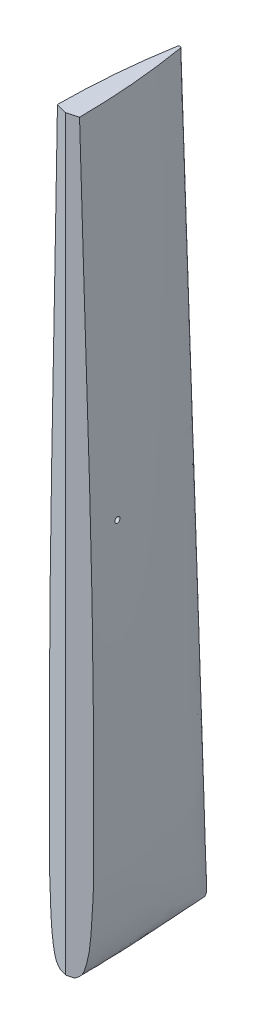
ISO-10303-21;
HEADER;
FILE_DESCRIPTION(('STEP AP214'),'2;1');
FILE_NAME('part.step','',(''),(''),'','','');
FILE_SCHEMA(('AUTOMOTIVE_DESIGN { 1 0 10303 214 1 1 1 1 }'));
ENDSEC;
DATA;
#1=APPLICATION_CONTEXT('core data for automotive mechanical design processes');
#2=APPLICATION_PROTOCOL_DEFINITION('international standard','automotive_design',2000,#1);
#3=PRODUCT_CONTEXT('',#1,'mechanical');
#4=PRODUCT('Part','Part','',(#3));
#5=PRODUCT_RELATED_PRODUCT_CATEGORY('part','',(#4));
#6=PRODUCT_DEFINITION_FORMATION('','',#4);
#7=PRODUCT_DEFINITION_CONTEXT('part definition',#1,'design');
#8=PRODUCT_DEFINITION('design','',#6,#7);
#9=PRODUCT_DEFINITION_SHAPE('','',#8);
#10=(LENGTH_UNIT() NAMED_UNIT(*) SI_UNIT(.MILLI.,.METRE.));
#11=(NAMED_UNIT(*) PLANE_ANGLE_UNIT() SI_UNIT($,.RADIAN.));
#12=(NAMED_UNIT(*) SI_UNIT($,.STERADIAN.) SOLID_ANGLE_UNIT());
#13=UNCERTAINTY_MEASURE_WITH_UNIT(LENGTH_MEASURE(1.E-05),#10,'distance_accuracy_value','');
#14=(GEOMETRIC_REPRESENTATION_CONTEXT(3) GLOBAL_UNCERTAINTY_ASSIGNED_CONTEXT((#13)) GLOBAL_UNIT_ASSIGNED_CONTEXT((#10,
#11,#12)) REPRESENTATION_CONTEXT('',''));
#15=CARTESIAN_POINT('',(0.,0.,0.));
#16=DIRECTION('',(0.,0.,1.));
#17=DIRECTION('',(1.,0.,0.));
#18=AXIS2_PLACEMENT_3D('',#15,#16,#17);
#19=CARTESIAN_POINT('',(-19.9884252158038,1862.44260537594,-6592.01307514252));
#20=CARTESIAN_POINT('',(-26.8934107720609,1534.70306334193,-6593.86326045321));
#21=CARTESIAN_POINT('',(-40.0090450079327,1193.89190828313,-6597.37757862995));
#22=CARTESIAN_POINT('',(-39.9456415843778,806.598983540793,-6597.3605964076));
#23=CARTESIAN_POINT('',(-39.6360081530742,736.310169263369,-6597.27761550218));
#24=CARTESIAN_POINT('',(-40.237000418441,657.372017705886,-6597.43867853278));
#25=CARTESIAN_POINT('',(-37.1722435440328,600.953489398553,-6596.61733831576));
#26=CARTESIAN_POINT('',(-34.4358947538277,551.281638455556,-6595.88426878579));
#27=CARTESIAN_POINT('',(-25.1261638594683,521.188880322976,-6593.38972770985));
#28=CARTESIAN_POINT('',(-18.4924407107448,514.41161983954,-6591.61222751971));
#29=CARTESIAN_POINT('',(-14.515562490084,511.746648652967,-6590.54662609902));
#30=CARTESIAN_POINT('',(-12.7654577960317,510.947751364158,-6590.07768688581));
#31=CARTESIAN_POINT('',(-19.9162503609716,1862.44260537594,-6608.71237045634));
#32=CARTESIAN_POINT('',(-26.6824629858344,1534.70302438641,-6611.44424600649));
#33=CARTESIAN_POINT('',(-39.7387025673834,1193.89190559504,-6615.83895151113));
#34=CARTESIAN_POINT('',(-39.6886844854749,806.598984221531,-6616.91658362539));
#35=CARTESIAN_POINT('',(-39.3845017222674,736.310161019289,-6617.02920022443));
#36=CARTESIAN_POINT('',(-39.9824966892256,657.372026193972,-6617.41780383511));
#37=CARTESIAN_POINT('',(-36.9483672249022,600.953412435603,-6616.73160858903));
#38=CARTESIAN_POINT('',(-34.2764068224,551.281840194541,-6616.18408088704));
#39=CARTESIAN_POINT('',(-25.0234337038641,521.188786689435,-6613.92521516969));
#40=CARTESIAN_POINT('',(-18.4583589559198,514.411767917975,-6612.17071322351));
#41=CARTESIAN_POINT('',(-14.4660919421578,511.746435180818,-6611.04009092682));
#42=CARTESIAN_POINT('',(-12.7433551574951,510.94775136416,-6610.52794310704));
#43=CARTESIAN_POINT('',(-19.0972393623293,1862.44260537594,-6642.06855271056));
#44=CARTESIAN_POINT('',(-25.5859061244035,1534.70294647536,-6646.56380873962));
#45=CARTESIAN_POINT('',(-37.7898809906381,1193.89190019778,-6652.71868118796));
#46=CARTESIAN_POINT('',(-37.7663977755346,806.598985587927,-6656.00318671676));
#47=CARTESIAN_POINT('',(-37.4864367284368,736.310144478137,-6656.5087060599));
#48=CARTESIAN_POINT('',(-38.0492083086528,657.372043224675,-6657.35830076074));
#49=CARTESIAN_POINT('',(-35.2196602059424,600.953258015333,-6656.93233834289));
#50=CARTESIAN_POINT('',(-32.6738335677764,551.282243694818,-6656.78619940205));
#51=CARTESIAN_POINT('',(-23.9683476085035,521.188599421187,-6655.02363964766));
#52=CARTESIAN_POINT('',(-17.7186768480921,514.412064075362,-6653.30803096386));
#53=CARTESIAN_POINT('',(-13.9706664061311,511.746008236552,-6652.03296403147));
#54=CARTESIAN_POINT('',(-12.3026654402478,510.947751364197,-6651.43439899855));
#55=CARTESIAN_POINT('',(-15.8536834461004,1862.44260537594,-6691.98307498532));
#56=CARTESIAN_POINT('',(-20.9725671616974,1534.70151698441,-6699.07198246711));
#57=CARTESIAN_POINT('',(-30.6765162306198,1193.89219290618,-6707.64087913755));
#58=CARTESIAN_POINT('',(-30.6737922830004,806.598921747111,-6714.26869760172));
#59=CARTESIAN_POINT('',(-30.4606008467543,736.31082502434,-6715.37486588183));
#60=CARTESIAN_POINT('',(-30.9002872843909,657.371342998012,-6716.91121172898));
#61=CARTESIAN_POINT('',(-28.7105620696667,600.959605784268,-6716.93618776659));
#62=CARTESIAN_POINT('',(-26.6535621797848,551.265581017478,-6717.4288279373));
#63=CARTESIAN_POINT('',(-19.7263008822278,521.196333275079,-6716.58548223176));
#64=CARTESIAN_POINT('',(-14.7624577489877,514.399833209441,-6714.95211653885));
#65=CARTESIAN_POINT('',(-11.7932212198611,511.763640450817,-6713.52257822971));
#66=CARTESIAN_POINT('',(-10.4518622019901,510.947751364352,-6712.77450785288));
#67=CARTESIAN_POINT('',(-10.5927394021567,1862.44260537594,-6741.78456812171));
#68=CARTESIAN_POINT('',(-13.6238322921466,1534.69958378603,-6751.14749141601));
#69=CARTESIAN_POINT('',(-19.4031656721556,1193.89308319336,-6761.90032273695));
#70=CARTESIAN_POINT('',(-19.4067289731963,806.598723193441,-6771.88321733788));
#71=CARTESIAN_POINT('',(-19.2916218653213,736.312987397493,-6773.60315615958));
#72=CARTESIAN_POINT('',(-19.5365227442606,657.369117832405,-6775.80793381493));
#73=CARTESIAN_POINT('',(-18.3291502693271,600.97977832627,-6776.38989807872));
#74=CARTESIAN_POINT('',(-16.9875731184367,551.21263875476,-6777.64892158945));
#75=CARTESIAN_POINT('',(-12.8636519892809,521.220905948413,-6777.8448849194));
#76=CARTESIAN_POINT('',(-9.92504748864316,514.360972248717,-6776.48834876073));
#77=CARTESIAN_POINT('',(-8.24044361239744,511.819663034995,-6774.88404182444));
#78=CARTESIAN_POINT('',(-7.41257612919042,510.947751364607,-6774.05764416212));
#79=CARTESIAN_POINT('',(-5.73178554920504,1862.44260537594,-6774.91438434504));
#80=CARTESIAN_POINT('',(-6.95005337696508,1534.69844182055,-6785.93160088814));
#81=CARTESIAN_POINT('',(-9.14031393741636,1193.89333758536,-6797.45035419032));
#82=CARTESIAN_POINT('',(-9.14698438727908,806.598667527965,-6809.66951714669));
#83=CARTESIAN_POINT('',(-9.11443164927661,736.313582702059,-6811.81722411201));
#84=CARTESIAN_POINT('',(-9.19165029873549,657.368505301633,-6814.42920370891));
#85=CARTESIAN_POINT('',(-8.82374017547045,600.985331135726,-6815.57274283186));
#86=CARTESIAN_POINT('',(-8.20497107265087,551.198059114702,-6817.19289755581));
#87=CARTESIAN_POINT('',(-6.53260109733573,521.227673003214,-6818.43992058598));
#88=CARTESIAN_POINT('',(-5.49926350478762,514.350270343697,-6817.25245268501));
#89=CARTESIAN_POINT('',(-4.89204023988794,511.835091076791,-6815.84841990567));
#90=CARTESIAN_POINT('',(-4.59593421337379,510.947751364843,-6814.85022402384));
#91=CARTESIAN_POINT('',(-2.90726529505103,1862.44260537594,-6791.769707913));
#92=CARTESIAN_POINT('',(-3.01822730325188,1534.69799037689,-6803.25171530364));
#93=CARTESIAN_POINT('',(-3.22420466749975,1193.89361058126,-6815.35476177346));
#94=CARTESIAN_POINT('',(-3.23358048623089,806.598606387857,-6828.70698397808));
#95=CARTESIAN_POINT('',(-3.24789930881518,736.314251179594,-6831.07101484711));
#96=CARTESIAN_POINT('',(-3.23097702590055,657.36781739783,-6833.89211280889));
#97=CARTESIAN_POINT('',(-3.33625141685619,600.991567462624,-6835.30790331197));
#98=CARTESIAN_POINT('',(-3.13502808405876,551.18168983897,-6837.3147342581));
#99=CARTESIAN_POINT('',(-2.87490401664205,521.23527067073,-6838.94108612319));
#100=CARTESIAN_POINT('',(-2.9333002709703,514.338254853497,-6838.05836064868));
#101=CARTESIAN_POINT('',(-2.95172261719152,511.852412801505,-6836.53179707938));
#102=CARTESIAN_POINT('',(-2.96093290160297,510.94775136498,-6835.60286038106));
#103=CARTESIAN_POINT('',(-2.703821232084,1862.44260537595,-6792.39226174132));
#104=CARTESIAN_POINT('',(-2.7742950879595,1534.6979740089,-6803.89095612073));
#105=CARTESIAN_POINT('',(-2.907831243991,1193.89362062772,-6815.99160510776));
#106=CARTESIAN_POINT('',(-2.9073287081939,806.598604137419,-6829.37180240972));
#107=CARTESIAN_POINT('',(-2.92371771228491,736.314275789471,-6831.74552665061));
#108=CARTESIAN_POINT('',(-2.89782128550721,657.367792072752,-6834.56407168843));
#109=CARTESIAN_POINT('',(-3.01962940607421,600.991797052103,-6836.0060169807));
#110=CARTESIAN_POINT('',(-2.82905251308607,551.181087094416,-6838.00840111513));
#111=CARTESIAN_POINT('',(-2.60372173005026,521.235550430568,-6839.63038574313));
#112=CARTESIAN_POINT('',(-2.69697069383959,514.337812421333,-6838.77944870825));
#113=CARTESIAN_POINT('',(-2.73651776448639,511.853050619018,-6837.26894546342));
#114=CARTESIAN_POINT('',(-2.75688080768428,510.947751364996,-6836.34263948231));
#115=CARTESIAN_POINT('',(-2.06532865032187,1862.44260537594,-6793.23024546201));
#116=CARTESIAN_POINT('',(-2.08668633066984,1534.69794386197,-6804.71457469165));
#117=CARTESIAN_POINT('',(-2.1364273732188,1193.8936797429,-6816.78424857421));
#118=CARTESIAN_POINT('',(-2.12446989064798,806.598590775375,-6830.17736325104));
#119=CARTESIAN_POINT('',(-2.13222259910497,736.314423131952,-6832.55257814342));
#120=CARTESIAN_POINT('',(-2.11437427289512,657.367640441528,-6835.37450189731));
#121=CARTESIAN_POINT('',(-2.21967160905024,600.993171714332,-6836.86253061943));
#122=CARTESIAN_POINT('',(-2.06697412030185,551.177479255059,-6838.8259519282));
#123=CARTESIAN_POINT('',(-1.89886843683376,521.237224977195,-6840.4298400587));
#124=CARTESIAN_POINT('',(-1.99791275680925,514.335164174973,-6839.63709782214));
#125=CARTESIAN_POINT('',(-2.04673541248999,511.856868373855,-6838.16225068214));
#126=CARTESIAN_POINT('',(-2.07232559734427,510.947751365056,-6837.25409808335));
#127=CARTESIAN_POINT('',(-1.12493338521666,1862.44260537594,-6793.82303299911));
#128=CARTESIAN_POINT('',(-1.12473486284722,1534.69791711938,-6805.28426211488));
#129=CARTESIAN_POINT('',(-1.13457216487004,1193.89372959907,-6817.31562936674));
#130=CARTESIAN_POINT('',(-1.12089486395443,806.598579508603,-6830.6998133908));
#131=CARTESIAN_POINT('',(-1.12856913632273,736.314547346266,-6833.08733839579));
#132=CARTESIAN_POINT('',(-1.10958429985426,657.367512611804,-6835.88419772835));
#133=CARTESIAN_POINT('',(-1.17782823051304,600.994330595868,-6837.42807743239));
#134=CARTESIAN_POINT('',(-1.08908087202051,551.174437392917,-6839.35155551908));
#135=CARTESIAN_POINT('',(-0.997618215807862,521.238636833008,-6840.91757005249));
#136=CARTESIAN_POINT('',(-1.06011190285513,514.332931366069,-6840.18539431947));
#137=CARTESIAN_POINT('',(-1.09254822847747,511.86008722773,-6838.7441047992));
#138=CARTESIAN_POINT('',(-1.1097593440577,510.947751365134,-6837.85078941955));
#139=CARTESIAN_POINT('',(-1.03955804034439E-07,1862.44260537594,-6794.03879446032));
#140=CARTESIAN_POINT('',(-9.88560035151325E-08,1534.69790612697,-6805.48836037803));
#141=CARTESIAN_POINT('',(9.66866766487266E-06,1193.89375068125,-6817.4979327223));
#142=CARTESIAN_POINT('',(-2.30349892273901E-06,806.598574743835,-6830.88198500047));
#143=CARTESIAN_POINT('',(2.44293330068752E-05,736.314599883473,-6833.26147901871));
#144=CARTESIAN_POINT('',(-2.53190806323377E-05,657.3674585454,-6836.07142055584));
#145=CARTESIAN_POINT('',(0.000228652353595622,600.994820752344,-6837.62150865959));
#146=CARTESIAN_POINT('',(-1.016185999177E-05,551.173150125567,-6839.53005486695));
#147=CARTESIAN_POINT('',(3.5309967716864E-07,521.239234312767,-6841.08915153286));
#148=CARTESIAN_POINT('',(-1.41525642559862E-07,514.331986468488,-6840.3732158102));
#149=CARTESIAN_POINT('',(-1.02709098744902E-07,511.861449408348,-6838.9449439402));
#150=CARTESIAN_POINT('',(-1.12059392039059E-07,510.947751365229,-6838.05820848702));
#151=CARTESIAN_POINT('',(1.12493321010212,1862.44260537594,-6793.82303307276));
#152=CARTESIAN_POINT('',(1.12473469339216,1534.69791711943,-6805.28426217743));
#153=CARTESIAN_POINT('',(1.13459150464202,1193.89372956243,-6817.31562936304));
#154=CARTESIAN_POINT('',(1.12089028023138,806.598579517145,-6830.69981344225));
#155=CARTESIAN_POINT('',(1.12861796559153,736.314547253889,-6833.08733831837));
#156=CARTESIAN_POINT('',(1.10953372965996,657.36751270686,-6835.8841978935));
#157=CARTESIAN_POINT('',(1.17828513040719,600.994329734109,-6837.42807634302));
#158=CARTESIAN_POINT('',(1.0890605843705,551.174437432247,-6839.35155561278));
#159=CARTESIAN_POINT('',(0.997618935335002,521.238636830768,-6840.9175700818));
#160=CARTESIAN_POINT('',(1.06011163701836,514.332931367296,-6840.18539436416));
#161=CARTESIAN_POINT('',(1.09254804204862,511.860087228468,-6838.74410484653));
#162=CARTESIAN_POINT('',(1.1097591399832,510.947751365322,-6837.85078946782));
#163=CARTESIAN_POINT('',(2.06532855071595,1862.44260537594,-6793.23024556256));
#164=CARTESIAN_POINT('',(2.08668622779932,1534.69794386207,-6804.7145747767));
#165=CARTESIAN_POINT('',(2.13644672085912,1193.89367967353,-6816.78424855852));
#166=CARTESIAN_POINT('',(2.12446536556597,806.598590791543,-6830.17736332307));
#167=CARTESIAN_POINT('',(2.13227136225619,736.314422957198,-6832.55257801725));
#168=CARTESIAN_POINT('',(2.11432386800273,657.367640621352,-6835.37450214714));
#169=CARTESIAN_POINT('',(2.2201274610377,600.993170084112,-6836.86252895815));
#170=CARTESIAN_POINT('',(2.06695392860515,551.177479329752,-6838.82595206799));
#171=CARTESIAN_POINT('',(1.89886918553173,521.23722497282,-6840.42984010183));
#172=CARTESIAN_POINT('',(1.99791253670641,514.335164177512,-6839.63709788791));
#173=CARTESIAN_POINT('',(2.04673527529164,511.856868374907,-6838.16225074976));
#174=CARTESIAN_POINT('',(2.07232544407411,510.947751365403,-6837.25409815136));
#175=CARTESIAN_POINT('',(2.70382120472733,1862.44260537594,-6792.3922618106));
#176=CARTESIAN_POINT('',(2.77429505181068,1534.69797400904,-6803.89095617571));
#177=CARTESIAN_POINT('',(2.90785059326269,1193.89362053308,-6815.99160507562));
#178=CARTESIAN_POINT('',(2.90732425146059,806.598604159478,-6829.37180245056));
#179=CARTESIAN_POINT('',(2.9237663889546,736.314275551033,-6831.74552653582));
#180=CARTESIAN_POINT('',(2.89777108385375,657.367792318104,-6834.56407187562));
#181=CARTESIAN_POINT('',(3.0200839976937,600.99179482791,-6836.00601561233));
#182=CARTESIAN_POINT('',(2.82903243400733,551.18108719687,-6838.00840122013));
#183=CARTESIAN_POINT('',(2.60372252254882,521.235550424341,-6839.63038576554));
#184=CARTESIAN_POINT('',(2.69697052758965,514.337812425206,-6838.77944875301));
#185=CARTESIAN_POINT('',(2.73651768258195,511.853050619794,-6837.26894550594));
#186=CARTESIAN_POINT('',(2.75688071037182,510.94775136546,-6836.34263952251));
#187=CARTESIAN_POINT('',(2.90726529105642,1862.44260537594,-6791.76970793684));
#188=CARTESIAN_POINT('',(3.01822729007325,1534.69799037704,-6803.2517153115));
#189=CARTESIAN_POINT('',(3.22422401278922,1193.89361047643,-6815.35476172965));
#190=CARTESIAN_POINT('',(3.23357605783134,806.598606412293,-6828.70698396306));
#191=CARTESIAN_POINT('',(3.24794794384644,736.314250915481,-6831.07101477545));
#192=CARTESIAN_POINT('',(3.23092691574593,657.367817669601,-6833.89211285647));
#193=CARTESIAN_POINT('',(3.33670541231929,600.991564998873,-6835.30790274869));
#194=CARTESIAN_POINT('',(3.13500805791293,551.181689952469,-6837.31473427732));
#195=CARTESIAN_POINT('',(2.87490482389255,521.235270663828,-6838.9410861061));
#196=CARTESIAN_POINT('',(2.93330012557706,514.338254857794,-6838.05836064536));
#197=CARTESIAN_POINT('',(2.95172255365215,511.852412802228,-6836.53179707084));
#198=CARTESIAN_POINT('',(2.96093282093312,510.947751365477,-6835.60286036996));
#199=CARTESIAN_POINT('',(5.73178554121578,1862.44260537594,-6774.91438439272));
#200=CARTESIAN_POINT('',(6.95005326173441,1534.69844182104,-6785.9316009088));
#201=CARTESIAN_POINT('',(9.14033266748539,1193.89333730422,-6797.450355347));
#202=CARTESIAN_POINT('',(9.14697975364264,806.598667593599,-6809.66951678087));
#203=CARTESIAN_POINT('',(9.11447915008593,736.313581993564,-6811.81722715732));
#204=CARTESIAN_POINT('',(9.19160085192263,657.368506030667,-6814.42920044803));
#205=CARTESIAN_POINT('',(8.82418561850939,600.985324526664,-6815.57277175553));
#206=CARTESIAN_POINT('',(8.20495119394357,551.198059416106,-6817.19289617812));
#207=CARTESIAN_POINT('',(6.53260156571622,521.227672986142,-6818.43992061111));
#208=CARTESIAN_POINT('',(5.49926312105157,514.350270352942,-6817.25245261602));
#209=CARTESIAN_POINT('',(4.89203991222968,511.835091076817,-6815.84841987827));
#210=CARTESIAN_POINT('',(4.59593384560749,510.947751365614,-6814.85022399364));
#211=CARTESIAN_POINT('',(10.5927394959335,1862.44260537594,-6741.78456754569));
#212=CARTESIAN_POINT('',(13.6238321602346,1534.69958378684,-6751.14749071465));
#213=CARTESIAN_POINT('',(19.4031834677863,1193.89308260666,-6761.90032631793));
#214=CARTESIAN_POINT('',(19.4067242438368,806.598723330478,-6771.88321540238));
#215=CARTESIAN_POINT('',(19.2916673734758,736.312985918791,-6773.60316644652));
#216=CARTESIAN_POINT('',(19.5364749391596,657.369119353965,-6775.80792141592));
#217=CARTESIAN_POINT('',(18.329578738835,600.97976453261,-6776.39000142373));
#218=CARTESIAN_POINT('',(16.9875537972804,551.212639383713,-6777.64891596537));
#219=CARTESIAN_POINT('',(12.8636520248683,521.220905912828,-6777.84488426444));
#220=CARTESIAN_POINT('',(9.92504680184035,514.360972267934,-6776.48834776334));
#221=CARTESIAN_POINT('',(8.24044290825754,511.819663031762,-6774.8840408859));
#222=CARTESIAN_POINT('',(7.41257534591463,510.947751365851,-6774.05764327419));
#223=CARTESIAN_POINT('',(15.8536836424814,1862.44260537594,-6691.98307288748));
#224=CARTESIAN_POINT('',(20.9725670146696,1534.70151698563,-6699.07198014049));
#225=CARTESIAN_POINT('',(30.6765333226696,1193.89219198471,-6707.64088646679));
#226=CARTESIAN_POINT('',(30.6737874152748,806.598921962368,-6714.26869251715));
#227=CARTESIAN_POINT('',(30.4606449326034,736.310822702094,-6715.37488814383));
#228=CARTESIAN_POINT('',(30.9002405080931,657.371345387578,-6716.91118313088));
#229=CARTESIAN_POINT('',(28.7109790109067,600.959584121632,-6716.93641861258));
#230=CARTESIAN_POINT('',(26.6535431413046,551.265582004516,-6717.42881447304));
#231=CARTESIAN_POINT('',(19.7263005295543,521.196333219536,-6716.58547991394));
#232=CARTESIAN_POINT('',(14.7624567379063,514.399833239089,-6714.95211338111));
#233=CARTESIAN_POINT('',(11.7932201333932,511.763640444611,-6713.5225752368));
#234=CARTESIAN_POINT('',(10.4518610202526,510.947751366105,-6712.77450495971));
#235=CARTESIAN_POINT('',(19.0972394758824,1862.44260537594,-6642.06855005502));
#236=CARTESIAN_POINT('',(25.5859057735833,1534.7029464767,-6646.56380578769));
#237=CARTESIAN_POINT('',(37.7898980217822,1193.89189906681,-6652.71869246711));
#238=CARTESIAN_POINT('',(37.7663924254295,806.59898585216,-6656.00317986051));
#239=CARTESIAN_POINT('',(37.4864812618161,736.310141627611,-6656.50873920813));
#240=CARTESIAN_POINT('',(38.0491602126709,657.372046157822,-6657.35825947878));
#241=CARTESIAN_POINT('',(35.2200848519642,600.953231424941,-6656.93267678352));
#242=CARTESIAN_POINT('',(32.6738137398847,551.282244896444,-6656.78618027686));
#243=CARTESIAN_POINT('',(23.9683469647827,521.188599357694,-6655.02363684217));
#244=CARTESIAN_POINT('',(17.7186755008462,514.41206410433,-6653.30802690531));
#245=CARTESIAN_POINT('',(13.9706650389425,511.746008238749,-6652.03296021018));
#246=CARTESIAN_POINT('',(12.3026640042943,510.947751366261,-6651.43439532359));
#247=CARTESIAN_POINT('',(19.91625036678,1862.44260537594,-6608.71236911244));
#248=CARTESIAN_POINT('',(26.6824625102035,1534.70302438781,-6611.44424446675));
#249=CARTESIAN_POINT('',(39.7387200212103,1193.89190440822,-6615.83896562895));
#250=CARTESIAN_POINT('',(39.6886787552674,806.59898449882,-6616.91657798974));
#251=CARTESIAN_POINT('',(39.3845476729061,736.310158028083,-6617.02923841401));
#252=CARTESIAN_POINT('',(39.9824465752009,657.372029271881,-6617.41776053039));
#253=CARTESIAN_POINT('',(36.9488074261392,600.95338453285,-6616.73198117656));
#254=CARTESIAN_POINT('',(34.2763859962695,551.281841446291,-6616.18406187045));
#255=CARTESIAN_POINT('',(25.0234330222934,521.188786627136,-6613.92521406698));
#256=CARTESIAN_POINT('',(18.4583574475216,514.411767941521,-6612.17071072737));
#257=CARTESIAN_POINT('',(14.466090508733,511.746435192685,-6611.04008869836));
#258=CARTESIAN_POINT('',(12.7433536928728,510.947751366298,-6610.52794102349));
#259=CARTESIAN_POINT('',(19.9884252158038,1862.44260537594,-6592.01307514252));
#260=CARTESIAN_POINT('',(26.8934102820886,1534.70306334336,-6593.86326030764));
#261=CARTESIAN_POINT('',(40.0090628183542,1193.89190708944,-6597.37759423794));
#262=CARTESIAN_POINT('',(39.9456357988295,806.598983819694,-6597.36059234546));
#263=CARTESIAN_POINT('',(39.6360549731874,736.310166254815,-6597.2776552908));
#264=CARTESIAN_POINT('',(40.2369493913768,657.372020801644,-6597.43863682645));
#265=CARTESIAN_POINT('',(37.1726919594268,600.953461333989,-6596.61771260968));
#266=CARTESIAN_POINT('',(34.4358735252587,551.281639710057,-6595.88425140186));
#267=CARTESIAN_POINT('',(25.1261632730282,521.18888026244,-6593.38972825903));
#268=CARTESIAN_POINT('',(18.4924391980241,514.411619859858,-6591.61222667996));
#269=CARTESIAN_POINT('',(14.5155610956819,511.746648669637,-6590.5466255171));
#270=CARTESIAN_POINT('',(12.7654563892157,510.9477513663,-6590.0776864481));
#271=B_SPLINE_SURFACE_WITH_KNOTS('',3,3,((#19,#20,#21,#22,#23,#24,#25,#26,#27,#28,#29,#30),(#31,
#32,#33,#34,#35,#36,#37,#38,#39,#40,#41,#42),(#43,#44,#45,#46,#47,#48,#49,#50,#51,#52,#53,#54),
(#55,#56,#57,#58,#59,#60,#61,#62,#63,#64,#65,#66),(#67,#68,#69,#70,#71,#72,#73,#74,#75,#76,#77,
#78),(#79,#80,#81,#82,#83,#84,#85,#86,#87,#88,#89,#90),(#91,#92,#93,#94,#95,#96,#97,#98,#99,
#100,#101,#102),(#103,#104,#105,#106,#107,#108,#109,#110,#111,#112,#113,#114),(#115,#116,#117,
#118,#119,#120,#121,#122,#123,#124,#125,#126),(#127,#128,#129,#130,#131,#132,#133,#134,#135,
#136,#137,#138),(#139,#140,#141,#142,#143,#144,#145,#146,#147,#148,#149,#150),(#151,#152,#153,
#154,#155,#156,#157,#158,#159,#160,#161,#162),(#163,#164,#165,#166,#167,#168,#169,#170,#171,
#172,#173,#174),(#175,#176,#177,#178,#179,#180,#181,#182,#183,#184,#185,#186),(#187,#188,#189,
#190,#191,#192,#193,#194,#195,#196,#197,#198),(#199,#200,#201,#202,#203,#204,#205,#206,#207,
#208,#209,#210),(#211,#212,#213,#214,#215,#216,#217,#218,#219,#220,#221,#222),(#223,#224,#225,
#226,#227,#228,#229,#230,#231,#232,#233,#234),(#235,#236,#237,#238,#239,#240,#241,#242,#243,
#244,#245,#246),(#247,#248,#249,#250,#251,#252,#253,#254,#255,#256,#257,#258),(#259,#260,#261,
#262,#263,#264,#265,#266,#267,#268,#269,#270)),.UNSPECIFIED.,.F.,.F.,.F.,(4,1,1,1,2,1,1,1,1,1,1,
1,2,1,1,1,4),(4,1,1,1,1,1,1,1,1,4),(0.,0.12272175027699,0.24544350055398,0.36816525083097,
0.49088700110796,0.493165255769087,0.495443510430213,0.49772176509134,0.500000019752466,
0.502278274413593,0.504556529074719,0.506834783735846,0.509113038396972,0.631834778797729,
0.754556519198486,0.877278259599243,1.),(0.,0.726006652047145,0.755007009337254,
0.857831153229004,0.881685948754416,0.92986213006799,0.982734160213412,0.992069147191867,
0.996831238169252,1.),.UNSPECIFIED.);
#272=CARTESIAN_POINT('',(1219.21686283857,1862.44260537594,-6586.65719274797));
#273=DIRECTION('',(0.,1.,0.));
#274=DIRECTION('',(0.,0.,-1.));
#275=AXIS2_PLACEMENT_3D('',#272,#273,#274);
#276=CIRCLE('',#275,1239.21686214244);
#277=CARTESIAN_POINT('',(-2.95874510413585,1862.44260537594,-6791.4625021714));
#278=VERTEX_POINT('',#277);
#279=CARTESIAN_POINT('',(-19.988425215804,1862.44260537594,-6592.01307514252));
#280=VERTEX_POINT('',#279);
#281=EDGE_CURVE('E247',#278,#280,#276,.T.);
#282=CARTESIAN_POINT('',(0.,1862.44260537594,-6790.96669231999));
#283=DIRECTION('',(0.,1.,0.));
#284=DIRECTION('',(0.,0.,1.));
#285=AXIS2_PLACEMENT_3D('',#282,#283,#284);
#286=CIRCLE('',#285,2.99999999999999);
#287=CARTESIAN_POINT('',(2.95874510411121,1862.44260537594,-6791.46250217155));
#288=VERTEX_POINT('',#287);
#289=EDGE_CURVE('E413',#288,#278,#286,.T.);
#290=CARTESIAN_POINT('',(-1219.21686283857,1862.44260537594,-6586.65719274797));
#291=DIRECTION('',(0.,1.,0.));
#292=DIRECTION('',(0.,0.,1.));
#293=AXIS2_PLACEMENT_3D('',#290,#291,#292);
#294=CIRCLE('',#293,1239.21686214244);
#295=CARTESIAN_POINT('',(19.9884252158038,1862.44260537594,-6592.01307514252));
#296=VERTEX_POINT('',#295);
#297=EDGE_CURVE('E420',#296,#288,#294,.T.);
#298=CARTESIAN_POINT('',(19.9884252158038,1862.44260537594,-6592.01307514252));
#299=CARTESIAN_POINT('',(26.8934102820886,1534.70306334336,-6593.86326030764));
#300=CARTESIAN_POINT('',(40.0090628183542,1193.89190708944,-6597.37759423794));
#301=CARTESIAN_POINT('',(39.9456357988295,806.598983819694,-6597.36059234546));
#302=CARTESIAN_POINT('',(39.6360549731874,736.310166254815,-6597.2776552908));
#303=CARTESIAN_POINT('',(40.2369493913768,657.372020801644,-6597.43863682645));
#304=CARTESIAN_POINT('',(37.1726919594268,600.953461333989,-6596.61771260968));
#305=CARTESIAN_POINT('',(34.4358735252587,551.281639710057,-6595.88425140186));
#306=CARTESIAN_POINT('',(25.1261632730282,521.18888026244,-6593.38972825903));
#307=CARTESIAN_POINT('',(18.4924391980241,514.411619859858,-6591.61222667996));
#308=CARTESIAN_POINT('',(14.5155610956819,511.746648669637,-6590.5466255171));
#309=CARTESIAN_POINT('',(12.7654563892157,510.9477513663,-6590.0776864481));
#310=B_SPLINE_CURVE_WITH_KNOTS('',3,(#298,#299,#300,#301,#302,#303,#304,#305,#306,#307,#308,
#309),.UNSPECIFIED.,.F.,.F.,(4,1,1,1,1,1,1,1,1,4),(0.,0.726006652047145,0.755007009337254,
0.857831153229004,0.881685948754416,0.92986213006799,0.982734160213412,0.992069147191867,
0.996831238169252,1.),.UNSPECIFIED.);
#311=CARTESIAN_POINT('',(12.7654563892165,510.9477513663,-6590.0776864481));
#312=VERTEX_POINT('',#311);
#313=EDGE_CURVE('E296',#296,#312,#310,.T.);
#314=CARTESIAN_POINT('',(-3152.0100930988,510.947751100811,-6586.65718756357));
#315=DIRECTION('',(-8.38886645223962E-11,1.,0.));
#316=DIRECTION('',(-1.,-8.38886645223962E-11,0.));
#317=AXIS2_PLACEMENT_3D('',#314,#315,#316);
#318=CIRCLE('',#317,3164.77739793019);
#319=CARTESIAN_POINT('',(2.99073241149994,510.94775136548,-6835.2246220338));
#320=VERTEX_POINT('',#319);
#321=EDGE_CURVE('E287',#312,#320,#318,.T.);
#322=CARTESIAN_POINT('',(-4.34023118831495E-08,510.947751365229,-6834.98899651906));
#323=DIRECTION('',(-8.38886645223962E-11,1.,0.));
#324=DIRECTION('',(1.,8.38886645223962E-11,0.));
#325=AXIS2_PLACEMENT_3D('',#322,#323,#324);
#326=CIRCLE('',#325,2.99999999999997);
#327=CARTESIAN_POINT('',(-2.99073249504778,510.947751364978,-6835.22462207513));
#328=VERTEX_POINT('',#327);
#329=EDGE_CURVE('E284',#320,#328,#326,.T.);
#330=CARTESIAN_POINT('',(3152.00940461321,510.947751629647,-6586.65719796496));
#331=DIRECTION('',(-8.38886645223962E-11,1.,0.));
#332=DIRECTION('',(1.,8.38886645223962E-11,0.));
#333=AXIS2_PLACEMENT_3D('',#330,#331,#332);
#334=CIRCLE('',#333,3164.77671084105);
#335=CARTESIAN_POINT('',(-12.765457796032,510.947751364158,-6590.07768688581));
#336=VERTEX_POINT('',#335);
#337=EDGE_CURVE('E280',#328,#336,#334,.T.);
#338=CARTESIAN_POINT('',(-19.9884252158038,1862.44260537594,-6592.01307514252));
#339=CARTESIAN_POINT('',(-26.8934107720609,1534.70306334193,-6593.86326045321));
#340=CARTESIAN_POINT('',(-40.0090450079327,1193.89190828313,-6597.37757862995));
#341=CARTESIAN_POINT('',(-39.9456415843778,806.598983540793,-6597.3605964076));
#342=CARTESIAN_POINT('',(-39.6360081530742,736.310169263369,-6597.27761550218));
#343=CARTESIAN_POINT('',(-40.237000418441,657.372017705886,-6597.43867853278));
#344=CARTESIAN_POINT('',(-37.1722435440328,600.953489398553,-6596.61733831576));
#345=CARTESIAN_POINT('',(-34.4358947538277,551.281638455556,-6595.88426878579));
#346=CARTESIAN_POINT('',(-25.1261638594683,521.188880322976,-6593.38972770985));
#347=CARTESIAN_POINT('',(-18.4924407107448,514.41161983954,-6591.61222751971));
#348=CARTESIAN_POINT('',(-14.515562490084,511.746648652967,-6590.54662609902));
#349=CARTESIAN_POINT('',(-12.7654577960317,510.947751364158,-6590.07768688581));
#350=B_SPLINE_CURVE_WITH_KNOTS('',3,(#338,#339,#340,#341,#342,#343,#344,#345,#346,#347,#348,
#349),.UNSPECIFIED.,.F.,.F.,(4,1,1,1,1,1,1,1,1,4),(0.,0.726006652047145,0.755007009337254,
0.857831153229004,0.881685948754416,0.92986213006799,0.982734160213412,0.992069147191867,
0.996831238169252,1.),.UNSPECIFIED.);
#351=EDGE_CURVE('E256',#336,#280,#350,.F.);
#352=CARTESIAN_POINT('',(34.1911148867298,1210.94775136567,-6641.65719274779));
#353=CARTESIAN_POINT('',(34.1883348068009,1211.08813491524,-6641.65719176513));
#354=CARTESIAN_POINT('',(34.1851504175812,1211.22849429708,-6641.66310752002));
#355=CARTESIAN_POINT('',(34.1779940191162,1211.50824400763,-6641.68672466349));
#356=CARTESIAN_POINT('',(34.1740217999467,1211.64763406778,-6641.70442919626));
#357=CARTESIAN_POINT('',(34.1653131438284,1211.92453037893,-6641.75151800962));
#358=CARTESIAN_POINT('',(34.160576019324,1212.0620348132,-6641.78091283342));
#359=CARTESIAN_POINT('',(34.1503689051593,1212.33410596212,-6641.85117906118));
#360=CARTESIAN_POINT('',(34.1448986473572,1212.46867158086,-6641.89205467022));
#361=CARTESIAN_POINT('',(34.133266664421,1212.73373144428,-6641.98493656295));
#362=CARTESIAN_POINT('',(34.1271055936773,1212.86422939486,-6642.03693235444));
#363=CARTESIAN_POINT('',(34.1141235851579,1213.12040998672,-6642.15172240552));
#364=CARTESIAN_POINT('',(34.1073024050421,1213.24609083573,-6642.21452063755));
#365=CARTESIAN_POINT('',(34.0930482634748,1213.49162208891,-6642.35040770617));
#366=CARTESIAN_POINT('',(34.0856156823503,1213.611476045,-6642.4234901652));
#367=CARTESIAN_POINT('',(34.0701773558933,1213.84463545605,-6642.57947967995));
#368=CARTESIAN_POINT('',(34.0621713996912,1213.95793847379,-6642.66239035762));
#369=CARTESIAN_POINT('',(34.0456256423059,1214.17730474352,-6642.83754450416));
#370=CARTESIAN_POINT('',(34.0370851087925,1214.28335762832,-6642.9298008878));
#371=CARTESIAN_POINT('',(34.0195289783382,1214.48734032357,-6643.1229256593));
#372=CARTESIAN_POINT('',(34.0105132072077,1214.58526712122,-6643.22379721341));
#373=CARTESIAN_POINT('',(33.9920674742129,1214.77223567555,-6643.43337001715));
#374=CARTESIAN_POINT('',(33.982637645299,1214.86128025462,-6643.5420687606));
#375=CARTESIAN_POINT('',(33.9634154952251,1215.02992650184,-6643.76659303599));
#376=CARTESIAN_POINT('',(33.9536230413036,1215.10952466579,-6643.88242118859));
#377=CARTESIAN_POINT('',(33.933719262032,1215.25883526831,-6644.12059057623));
#378=CARTESIAN_POINT('',(33.9236073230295,1215.32852706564,-6644.24294470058));
#379=CARTESIAN_POINT('',(33.903143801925,1215.4573641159,-6644.49312306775));
#380=CARTESIAN_POINT('',(33.8927921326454,1215.5165054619,-6644.6209493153));
#381=CARTESIAN_POINT('',(33.8719227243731,1215.62377452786,-6644.88107556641));
#382=CARTESIAN_POINT('',(33.8614050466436,1215.67190621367,-6645.01337393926));
#383=CARTESIAN_POINT('',(33.8402646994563,1215.75686098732,-6645.28159628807));
#384=CARTESIAN_POINT('',(33.8296419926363,1215.79367988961,-6645.41752158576));
#385=CARTESIAN_POINT('',(33.8083503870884,1215.85576544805,-6645.692186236));
#386=CARTESIAN_POINT('',(33.7976814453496,1215.88101643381,-6645.83092914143));
#387=CARTESIAN_POINT('',(33.7763835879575,1215.91972747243,-6646.11006737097));
#388=CARTESIAN_POINT('',(33.7657546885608,1215.93318316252,-6646.25046328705));
#389=CARTESIAN_POINT('',(33.7340462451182,1215.95563960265,-6646.67253249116));
#390=CARTESIAN_POINT('',(33.7131218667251,1215.94679681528,-6646.95538528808));
#391=CARTESIAN_POINT('',(33.6723327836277,1215.88159980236,-6647.51555505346));
#392=CARTESIAN_POINT('',(33.6524683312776,1215.82523431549,-6647.79287069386));
#393=CARTESIAN_POINT('',(33.6143822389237,1215.66656125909,-6648.33419389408));
#394=CARTESIAN_POINT('',(33.5961605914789,1215.56425389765,-6648.59820151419));
#395=CARTESIAN_POINT('',(33.5619598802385,1215.31673643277,-6649.10492101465));
#396=CARTESIAN_POINT('',(33.5459774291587,1215.17159218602,-6649.3476648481));
#397=CARTESIAN_POINT('',(33.5167441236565,1214.84242048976,-6649.80536743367));
#398=CARTESIAN_POINT('',(33.503493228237,1214.65839362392,-6650.02032660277));
#399=CARTESIAN_POINT('',(33.4802122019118,1214.25723213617,-6650.41570710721));
#400=CARTESIAN_POINT('',(33.4701730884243,1214.04019240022,-6650.59622418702));
#401=CARTESIAN_POINT('',(33.4536283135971,1213.57877857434,-6650.91827784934));
#402=CARTESIAN_POINT('',(33.4471225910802,1213.33440495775,-6651.05981510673));
#403=CARTESIAN_POINT('',(33.4379126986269,1212.82602717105,-6651.29947933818));
#404=CARTESIAN_POINT('',(33.4351975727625,1212.56208190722,-6651.39773085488));
#405=CARTESIAN_POINT('',(33.4336624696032,1212.02144853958,-6651.54860703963));
#406=CARTESIAN_POINT('',(33.4348424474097,1211.74476058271,-6651.60123223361));
#407=CARTESIAN_POINT('',(33.441087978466,1211.18694711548,-6651.65932234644));
#408=CARTESIAN_POINT('',(33.4461476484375,1210.90582895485,-6651.66485851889));
#409=CARTESIAN_POINT('',(33.4600046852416,1210.34672172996,-6651.62883620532));
#410=CARTESIAN_POINT('',(33.4688020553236,1210.06873266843,-6651.58727767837));
#411=CARTESIAN_POINT('',(33.4898701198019,1209.52354166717,-6651.45825055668));
#412=CARTESIAN_POINT('',(33.5021434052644,1209.25634794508,-6651.37074767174));
#413=CARTESIAN_POINT('',(33.5297674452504,1208.740496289,-6651.1523544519));
#414=CARTESIAN_POINT('',(33.5451182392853,1208.49183859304,-6651.02146355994));
#415=CARTESIAN_POINT('',(33.5784468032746,1208.01938646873,-6650.71963864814));
#416=CARTESIAN_POINT('',(33.5964315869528,1207.79566132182,-6650.54859695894));
#417=CARTESIAN_POINT('',(33.634415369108,1207.38012049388,-6650.17155323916));
#418=CARTESIAN_POINT('',(33.6544144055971,1207.18830541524,-6649.96555054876));
#419=CARTESIAN_POINT('',(33.6958582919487,1206.84136279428,-6649.52367486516));
#420=CARTESIAN_POINT('',(33.7173077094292,1206.68635882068,-6649.28770523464));
#421=CARTESIAN_POINT('',(33.7609132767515,1206.4182093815,-6648.7931747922));
#422=CARTESIAN_POINT('',(33.7830694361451,1206.30506448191,-6648.53461367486));
#423=CARTESIAN_POINT('',(33.8274717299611,1206.12359897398,-6648.00141022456));
#424=CARTESIAN_POINT('',(33.8497179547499,1206.05537937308,-6647.72673315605));
#425=CARTESIAN_POINT('',(33.8825873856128,1205.98844302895,-6647.30928978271));
#426=CARTESIAN_POINT('',(33.8934662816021,1205.97203047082,-6647.16916025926));
#427=CARTESIAN_POINT('',(33.9149842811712,1205.95109699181,-6646.88801156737));
#428=CARTESIAN_POINT('',(33.9256234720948,1205.94657166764,-6646.74699274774));
#429=CARTESIAN_POINT('',(33.946590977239,1205.94945538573,-6646.46499065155));
#430=CARTESIAN_POINT('',(33.9569191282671,1205.95687058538,-6646.32400743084));
#431=CARTESIAN_POINT('',(33.9771830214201,1205.98359107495,-6646.04319419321));
#432=CARTESIAN_POINT('',(33.9871189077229,1206.00289195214,-6645.90336376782));
#433=CARTESIAN_POINT('',(34.0065367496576,1206.05326035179,-6645.62575335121));
#434=CARTESIAN_POINT('',(34.0160185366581,1206.08433220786,-6645.48797413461));
#435=CARTESIAN_POINT('',(34.0344565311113,1206.15801402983,-6645.21555523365));
#436=CARTESIAN_POINT('',(34.0434129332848,1206.20061968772,-6645.08091439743));
#437=CARTESIAN_POINT('',(34.0607319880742,1206.29700782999,-6644.81587815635));
#438=CARTESIAN_POINT('',(34.0690954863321,1206.350773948,-6644.68547685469));
#439=CARTESIAN_POINT('',(34.0851861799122,1206.46912292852,-6644.42969700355));
#440=CARTESIAN_POINT('',(34.0929136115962,1206.53370174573,-6644.30431659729));
#441=CARTESIAN_POINT('',(34.1076896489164,1206.67325925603,-6644.05938787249));
#442=CARTESIAN_POINT('',(34.1147380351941,1206.74824129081,-6643.93984144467));
#443=CARTESIAN_POINT('',(34.1281078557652,1206.90803020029,-6643.70752820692));
#444=CARTESIAN_POINT('',(34.1344295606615,1206.992833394,-6643.59475888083));
#445=CARTESIAN_POINT('',(34.1462968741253,1207.17145814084,-6643.37704247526));
#446=CARTESIAN_POINT('',(34.1518444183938,1207.26525617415,-6643.27207620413));
#447=CARTESIAN_POINT('',(34.1621494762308,1207.46135108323,-6643.07044170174));
#448=CARTESIAN_POINT('',(34.1669072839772,1207.56364477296,-6642.97377038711));
#449=CARTESIAN_POINT('',(34.1756127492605,1207.77610034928,-6642.78932103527));
#450=CARTESIAN_POINT('',(34.1795599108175,1207.88626699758,-6642.70154845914));
#451=CARTESIAN_POINT('',(34.186619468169,1208.11358615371,-6642.53562736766));
#452=CARTESIAN_POINT('',(34.1897321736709,1208.23073604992,-6642.45747528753));
#453=CARTESIAN_POINT('',(34.1951062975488,1208.47102605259,-6642.3114401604));
#454=CARTESIAN_POINT('',(34.1973691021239,1208.59415603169,-6642.24354050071));
#455=CARTESIAN_POINT('',(34.2010414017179,1208.84565895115,-6642.1183678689));
#456=CARTESIAN_POINT('',(34.2024512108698,1208.97402994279,-6642.06109099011));
#457=CARTESIAN_POINT('',(34.204414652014,1209.23502740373,-6641.95759009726));
#458=CARTESIAN_POINT('',(34.2049690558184,1209.36764992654,-6641.91135615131));
#459=CARTESIAN_POINT('',(34.2052260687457,1209.63626971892,-6641.83021642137));
#460=CARTESIAN_POINT('',(34.2049289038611,1209.77226608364,-6641.79530763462));
#461=CARTESIAN_POINT('',(34.2033150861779,1210.08001023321,-6641.72998301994));
#462=CARTESIAN_POINT('',(34.2017687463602,1210.25243249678,-6641.70270803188));
#463=CARTESIAN_POINT('',(34.1973942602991,1210.59916604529,-6641.66631351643));
#464=CARTESIAN_POINT('',(34.1945661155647,1210.77347732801,-6641.65719396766));
#465=CARTESIAN_POINT('',(34.1911148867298,1210.94775136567,-6641.65719274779));
#466=B_SPLINE_CURVE_WITH_KNOTS('',3,(#352,#353,#354,#355,#356,#357,#358,#359,#360,#361,#362,
#363,#364,#365,#366,#367,#368,#369,#370,#371,#372,#373,#374,#375,#376,#377,#378,#379,#380,#381,
#382,#383,#384,#385,#386,#387,#388,#389,#390,#391,#392,#393,#394,#395,#396,#397,#398,#399,#400,
#401,#402,#403,#404,#405,#406,#407,#408,#409,#410,#411,#412,#413,#414,#415,#416,#417,#418,#419,
#420,#421,#422,#423,#424,#425,#426,#427,#428,#429,#430,#431,#432,#433,#434,#435,#436,#437,#438,
#439,#440,#441,#442,#443,#444,#445,#446,#447,#448,#449,#450,#451,#452,#453,#454,#455,#456,#457,
#458,#459,#460,#461,#462,#463,#464,#465),.UNSPECIFIED.,.T.,.F.,(4,2,2,2,2,2,2,2,2,2,2,2,2,2,2,2,
2,2,2,2,2,2,2,2,2,2,2,2,2,2,2,2,2,2,2,2,2,2,2,2,2,2,2,2,2,2,2,2,2,2,2,2,2,2,2,2,4),(0.,
0.421080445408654,0.842273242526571,1.26384676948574,1.68557490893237,2.1069068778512,
2.52839411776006,2.94962112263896,3.37100384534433,3.79297703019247,4.21510597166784,
4.63710034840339,5.05925078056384,5.48226831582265,5.90544217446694,6.32846335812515,
6.75164086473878,7.17538994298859,7.59929568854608,8.44619960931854,9.29330427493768,
10.1404051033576,10.9862103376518,11.832002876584,12.6754088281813,13.5188001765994,
14.3597487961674,15.2006877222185,16.0403539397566,16.8800208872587,17.7203154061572,
18.5606207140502,19.4032056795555,20.2458065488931,21.0911971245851,21.9365991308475,
22.7838954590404,23.2080016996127,23.6319508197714,24.0561186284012,24.4801290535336,
24.9042957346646,25.3283042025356,25.7516952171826,26.1749281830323,26.5982974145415,
27.0215084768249,27.4436416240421,27.865617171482,28.2878501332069,28.7099261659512,
29.1313107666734,29.5525400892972,29.9733891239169,30.3941264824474,30.9168620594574,
31.4395970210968),.UNSPECIFIED.);
#467=CARTESIAN_POINT('',(34.1911148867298,1210.94775136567,-6641.65719274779));
#468=VERTEX_POINT('',#467);
#469=EDGE_CURVE('E237',#468,#468,#466,.T.);
#470=ORIENTED_EDGE('',*,*,#281,.F.);
#471=ORIENTED_EDGE('',*,*,#289,.F.);
#472=ORIENTED_EDGE('',*,*,#297,.F.);
#473=ORIENTED_EDGE('',*,*,#313,.T.);
#474=ORIENTED_EDGE('',*,*,#321,.T.);
#475=ORIENTED_EDGE('',*,*,#329,.T.);
#476=ORIENTED_EDGE('',*,*,#337,.T.);
#477=ORIENTED_EDGE('',*,*,#351,.T.);
#478=EDGE_LOOP('',(#470,#471,#472,#473,#474,#475,#476,#477));
#479=FACE_BOUND('',#478,.T.);
#480=ORIENTED_EDGE('',*,*,#469,.T.);
#481=EDGE_LOOP('',(#480));
#482=FACE_BOUND('',#481,.T.);
#483=ADVANCED_FACE('F232',(#479,#482),#271,.T.);
#484=CARTESIAN_POINT('',(-3152.0100930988,510.947751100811,-6586.65718756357));
#485=DIRECTION('',(-8.38886645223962E-11,1.,0.));
#486=DIRECTION('',(-1.,-8.38886645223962E-11,0.));
#487=AXIS2_PLACEMENT_3D('',#484,#485,#486);
#488=PLANE('',#487);
#489=ORIENTED_EDGE('',*,*,#321,.F.);
#490=DIRECTION('',(0.965925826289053,8.10335607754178E-11,-0.258819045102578));
#491=VECTOR('',#490,1.);
#492=CARTESIAN_POINT('',(12.7654563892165,510.9477513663,-6590.0776864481));
#493=LINE('',#492,#491);
#494=CARTESIAN_POINT('',(1.1337550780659E-07,510.947751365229,-6586.65719274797));
#495=VERTEX_POINT('',#494);
#496=EDGE_CURVE('E396',#495,#312,#493,.T.);
#497=ORIENTED_EDGE('',*,*,#496,.F.);
#498=DIRECTION('',(0.965925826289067,8.10335504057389E-11,0.258819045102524));
#499=VECTOR('',#498,1.);
#500=CARTESIAN_POINT('',(1.1337550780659E-07,510.947751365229,-6586.65719274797));
#501=LINE('',#500,#499);
#502=EDGE_CURVE('E456',#336,#495,#501,.T.);
#503=ORIENTED_EDGE('',*,*,#502,.F.);
#504=ORIENTED_EDGE('',*,*,#337,.F.);
#505=ORIENTED_EDGE('',*,*,#329,.F.);
#506=EDGE_LOOP('',(#489,#497,#503,#504,#505));
#507=FACE_BOUND('',#506,.T.);
#508=ADVANCED_FACE('F234',(#507),#488,.F.);
#509=CARTESIAN_POINT('',(-1219.21686283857,1862.44260537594,-6586.65719274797));
#510=DIRECTION('',(0.,1.,0.));
#511=DIRECTION('',(0.,0.,1.));
#512=AXIS2_PLACEMENT_3D('',#509,#510,#511);
#513=PLANE('',#512);
#514=DIRECTION('',(0.965925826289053,0.,-0.258819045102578));
#515=VECTOR('',#514,1.);
#516=CARTESIAN_POINT('',(5.3776427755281E-13,1862.44260537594,-6586.65719274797));
#517=LINE('',#516,#515);
#518=CARTESIAN_POINT('',(5.3776427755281E-13,1862.44260537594,-6586.65719274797));
#519=VERTEX_POINT('',#518);
#520=EDGE_CURVE('E438',#519,#296,#517,.T.);
#521=ORIENTED_EDGE('',*,*,#520,.T.);
#522=ORIENTED_EDGE('',*,*,#297,.T.);
#523=ORIENTED_EDGE('',*,*,#289,.T.);
#524=ORIENTED_EDGE('',*,*,#281,.T.);
#525=DIRECTION('',(0.965925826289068,0.,0.258819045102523));
#526=VECTOR('',#525,1.);
#527=CARTESIAN_POINT('',(5.3776427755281E-13,1862.44260537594,-6586.65719274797));
#528=LINE('',#527,#526);
#529=EDGE_CURVE('E12',#280,#519,#528,.T.);
#530=ORIENTED_EDGE('',*,*,#529,.T.);
#531=EDGE_LOOP('',(#521,#522,#523,#524,#530));
#532=FACE_BOUND('',#531,.T.);
#533=ADVANCED_FACE('F319',(#532),#513,.T.);
#534=CARTESIAN_POINT('',(19.9884252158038,1862.44260537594,-6592.01307514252));
#535=CARTESIAN_POINT('',(26.8934102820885,1534.70306334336,-6593.86326030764));
#536=CARTESIAN_POINT('',(40.0090628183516,1193.89190708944,-6597.37759423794));
#537=CARTESIAN_POINT('',(39.9456357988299,806.598983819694,-6597.36059234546));
#538=CARTESIAN_POINT('',(39.6360549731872,736.310166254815,-6597.2776552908));
#539=CARTESIAN_POINT('',(40.236949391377,657.372020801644,-6597.43863682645));
#540=CARTESIAN_POINT('',(37.1726919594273,600.953461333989,-6596.61771260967));
#541=CARTESIAN_POINT('',(34.435873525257,551.281639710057,-6595.88425140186));
#542=CARTESIAN_POINT('',(25.1261632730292,521.18888026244,-6593.38972825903));
#543=CARTESIAN_POINT('',(18.4924391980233,514.411619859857,-6591.61222667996));
#544=CARTESIAN_POINT('',(14.5155610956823,511.746648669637,-6590.5466255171));
#545=CARTESIAN_POINT('',(12.7654563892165,510.9477513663,-6590.0776864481));
#546=CARTESIAN_POINT('',(13.325616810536,1862.44260537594,-6590.227781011));
#547=CARTESIAN_POINT('',(17.9289401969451,1534.70128515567,-6591.46123778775));
#548=CARTESIAN_POINT('',(26.6727018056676,1193.89296458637,-6593.80412707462));
#549=CARTESIAN_POINT('',(26.6304254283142,806.598747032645,-6593.79279247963));
#550=CARTESIAN_POINT('',(26.4240197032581,736.312754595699,-6593.73750110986));
#551=CARTESIAN_POINT('',(26.8246503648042,657.36935724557,-6593.84482213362));
#552=CARTESIAN_POINT('',(24.7816365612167,600.977608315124,-6593.29753932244));
#553=CARTESIAN_POINT('',(22.9572562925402,551.218290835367,-6592.80856518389));
#554=CARTESIAN_POINT('',(16.7507750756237,521.218282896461,-6591.14554975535));
#555=CARTESIAN_POINT('',(12.3282930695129,514.36512048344,-6589.96054870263));
#556=CARTESIAN_POINT('',(9.67704085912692,511.813682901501,-6589.25014792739));
#557=CARTESIAN_POINT('',(8.5103042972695,510.947751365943,-6588.93752188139));
#558=CARTESIAN_POINT('',(6.66280840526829,1862.44260537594,-6588.44248687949));
#559=CARTESIAN_POINT('',(8.96447011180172,1534.69950696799,-6589.05921526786));
#560=CARTESIAN_POINT('',(13.3363407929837,1193.89402208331,-6590.2306599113));
#561=CARTESIAN_POINT('',(13.3152150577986,806.598510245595,-6590.2249926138));
#562=CARTESIAN_POINT('',(13.211984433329,736.315342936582,-6590.19734692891));
#563=CARTESIAN_POINT('',(13.4123513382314,657.366693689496,-6590.2510074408));
#564=CARTESIAN_POINT('',(12.3905811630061,601.00175529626,-6589.97736603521));
#565=CARTESIAN_POINT('',(11.4786390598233,551.154941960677,-6589.73287896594));
#566=CARTESIAN_POINT('',(8.37538687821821,521.247685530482,-6588.90137125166));
#567=CARTESIAN_POINT('',(6.16414694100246,514.318621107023,-6588.3088707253));
#568=CARTESIAN_POINT('',(4.83852062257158,511.880717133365,-6587.95367033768));
#569=CARTESIAN_POINT('',(4.2551522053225,510.947751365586,-6587.79735731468));
#570=CARTESIAN_POINT('',(5.3776427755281E-13,1862.44260537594,-6586.65719274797));
#571=CARTESIAN_POINT('',(2.66583463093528E-08,1534.6977287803,-6586.65719274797));
#572=CARTESIAN_POINT('',(-2.02197003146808E-05,1193.89507958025,-6586.65719274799));
#573=CARTESIAN_POINT('',(4.68728294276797E-06,806.598273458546,-6586.65719274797));
#574=CARTESIAN_POINT('',(-5.08366000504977E-05,736.317931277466,-6586.65719274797));
#575=CARTESIAN_POINT('',(5.23116585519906E-05,657.364030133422,-6586.65719274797));
#576=CARTESIAN_POINT('',(-0.00047423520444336,601.025902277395,-6586.65719274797));
#577=CARTESIAN_POINT('',(2.18271064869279E-05,551.091593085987,-6586.65719274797));
#578=CARTESIAN_POINT('',(-1.31918727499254E-06,521.277088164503,-6586.65719274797));
#579=CARTESIAN_POINT('',(8.12492040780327E-07,514.272121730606,-6586.65719274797));
#580=CARTESIAN_POINT('',(3.86016236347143E-07,511.947751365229,-6586.65719274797));
#581=CARTESIAN_POINT('',(1.13375512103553E-07,510.947751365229,-6586.65719274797));
#582=B_SPLINE_SURFACE_WITH_KNOTS('',3,3,((#534,#535,#536,#537,#538,#539,#540,#541,#542,#543,
#544,#545),(#546,#547,#548,#549,#550,#551,#552,#553,#554,#555,#556,#557),(#558,#559,#560,#561,
#562,#563,#564,#565,#566,#567,#568,#569),(#570,#571,#572,#573,#574,#575,#576,#577,#578,#579,
#580,#581)),.UNSPECIFIED.,.F.,.F.,.F.,(4,4),(4,1,1,1,1,1,1,1,1,4),(0.,1.),(0.,0.726006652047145,
0.755007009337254,0.857831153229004,0.881685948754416,0.92986213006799,0.982734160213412,
0.992069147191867,0.996831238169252,1.),.UNSPECIFIED.);
#583=CARTESIAN_POINT('',(5.3776427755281E-13,1862.44260537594,-6586.65719274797));
#584=CARTESIAN_POINT('',(2.66583463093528E-08,1534.6977287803,-6586.65719274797));
#585=CARTESIAN_POINT('',(-2.02197003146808E-05,1193.89507958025,-6586.65719274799));
#586=CARTESIAN_POINT('',(4.68728294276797E-06,806.598273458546,-6586.65719274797));
#587=CARTESIAN_POINT('',(-5.08366000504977E-05,736.317931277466,-6586.65719274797));
#588=CARTESIAN_POINT('',(5.23116585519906E-05,657.364030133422,-6586.65719274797));
#589=CARTESIAN_POINT('',(-0.00047423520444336,601.025902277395,-6586.65719274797));
#590=CARTESIAN_POINT('',(2.18271064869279E-05,551.091593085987,-6586.65719274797));
#591=CARTESIAN_POINT('',(-1.31918727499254E-06,521.277088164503,-6586.65719274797));
#592=CARTESIAN_POINT('',(8.12492040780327E-07,514.272121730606,-6586.65719274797));
#593=CARTESIAN_POINT('',(3.86016236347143E-07,511.947751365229,-6586.65719274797));
#594=CARTESIAN_POINT('',(1.13375512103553E-07,510.947751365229,-6586.65719274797));
#595=B_SPLINE_CURVE_WITH_KNOTS('',3,(#583,#584,#585,#586,#587,#588,#589,#590,#591,#592,#593,
#594),.UNSPECIFIED.,.F.,.F.,(4,1,1,1,1,1,1,1,1,4),(0.,0.726006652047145,0.755007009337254,
0.857831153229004,0.881685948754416,0.92986213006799,0.982734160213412,0.992069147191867,
0.996831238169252,1.),.UNSPECIFIED.);
#596=EDGE_CURVE('E388',#519,#495,#595,.T.);
#597=ORIENTED_EDGE('',*,*,#520,.F.);
#598=ORIENTED_EDGE('',*,*,#596,.T.);
#599=ORIENTED_EDGE('',*,*,#496,.T.);
#600=ORIENTED_EDGE('',*,*,#313,.F.);
#601=EDGE_LOOP('',(#597,#598,#599,#600));
#602=FACE_BOUND('',#601,.T.);
#603=ADVANCED_FACE('F321',(#602),#582,.T.);
#604=CARTESIAN_POINT('',(5.3776427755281E-13,1862.44260537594,-6586.65719274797));
#605=CARTESIAN_POINT('',(2.66583463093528E-08,1534.6977287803,-6586.65719274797));
#606=CARTESIAN_POINT('',(-2.02197003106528E-05,1193.89507958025,-6586.65719274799));
#607=CARTESIAN_POINT('',(4.68728294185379E-06,806.598273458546,-6586.65719274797));
#608=CARTESIAN_POINT('',(-5.08366000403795E-05,736.317931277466,-6586.65719274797));
#609=CARTESIAN_POINT('',(5.23116585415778E-05,657.364030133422,-6586.65719274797));
#610=CARTESIAN_POINT('',(-0.00047423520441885,601.025902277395,-6586.65719274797));
#611=CARTESIAN_POINT('',(2.18271064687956E-05,551.091593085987,-6586.65719274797));
#612=CARTESIAN_POINT('',(-1.31918726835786E-06,521.277088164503,-6586.65719274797));
#613=CARTESIAN_POINT('',(8.12492040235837E-07,514.272121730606,-6586.65719274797));
#614=CARTESIAN_POINT('',(3.86016233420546E-07,511.947751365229,-6586.65719274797));
#615=CARTESIAN_POINT('',(1.1337550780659E-07,510.947751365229,-6586.65719274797));
#616=CARTESIAN_POINT('',(-6.66280840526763,1862.44260537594,-6588.44248687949));
#617=CARTESIAN_POINT('',(-8.96447023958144,1534.69950696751,-6589.05921531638));
#618=CARTESIAN_POINT('',(-13.3363618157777,1193.89402248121,-6590.23065470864));
#619=CARTESIAN_POINT('',(-13.315210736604,806.598510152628,-6590.22499396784));
#620=CARTESIAN_POINT('',(-13.2120366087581,736.315343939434,-6590.19733366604));
#621=CARTESIAN_POINT('',(-13.4122985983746,657.366692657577,-6590.25102134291));
#622=CARTESIAN_POINT('',(-12.3910640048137,601.001764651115,-6589.97724127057));
#623=CARTESIAN_POINT('',(-11.4786170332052,551.154941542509,-6589.73288476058));
#624=CARTESIAN_POINT('',(-8.37538883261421,521.247685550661,-6588.9013710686));
#625=CARTESIAN_POINT('',(-6.16414636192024,514.318621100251,-6588.30887100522));
#626=CARTESIAN_POINT('',(-4.83852057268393,511.880717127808,-6587.95367053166));
#627=CARTESIAN_POINT('',(-4.25515252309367,510.947751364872,-6587.79735746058));
#628=CARTESIAN_POINT('',(-13.3256168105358,1862.44260537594,-6590.227781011));
#629=CARTESIAN_POINT('',(-17.9289405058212,1534.70128515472,-6591.4612378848));
#630=CARTESIAN_POINT('',(-26.6727034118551,1193.89296538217,-6593.80411666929));
#631=CARTESIAN_POINT('',(-26.6304261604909,806.59874684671,-6593.79279518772));
#632=CARTESIAN_POINT('',(-26.4240223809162,736.312756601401,-6593.73747458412));
#633=CARTESIAN_POINT('',(-26.8246495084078,657.369355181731,-6593.84484993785));
#634=CARTESIAN_POINT('',(-24.7816537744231,600.977627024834,-6593.29728979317));
#635=CARTESIAN_POINT('',(-22.9572558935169,551.218289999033,-6592.80857677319));
#636=CARTESIAN_POINT('',(-16.7507763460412,521.218282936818,-6591.14554938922));
#637=CARTESIAN_POINT('',(-12.3282935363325,514.365120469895,-6589.96054926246));
#638=CARTESIAN_POINT('',(-9.67704153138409,511.813682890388,-6589.25014831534));
#639=CARTESIAN_POINT('',(-8.51030515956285,510.947751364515,-6588.9375221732));
#640=CARTESIAN_POINT('',(-19.988425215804,1862.44260537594,-6592.01307514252));
#641=CARTESIAN_POINT('',(-26.893410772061,1534.70306334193,-6593.86326045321));
#642=CARTESIAN_POINT('',(-40.0090450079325,1193.89190828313,-6597.37757862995));
#643=CARTESIAN_POINT('',(-39.9456415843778,806.598983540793,-6597.3605964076));
#644=CARTESIAN_POINT('',(-39.6360081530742,736.310169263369,-6597.27761550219));
#645=CARTESIAN_POINT('',(-40.237000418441,657.372017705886,-6597.43867853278));
#646=CARTESIAN_POINT('',(-37.1722435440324,600.953489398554,-6596.61733831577));
#647=CARTESIAN_POINT('',(-34.4358947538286,551.281638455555,-6595.88426878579));
#648=CARTESIAN_POINT('',(-25.1261638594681,521.188880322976,-6593.38972770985));
#649=CARTESIAN_POINT('',(-18.4924407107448,514.41161983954,-6591.61222751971));
#650=CARTESIAN_POINT('',(-14.5155624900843,511.746648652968,-6590.54662609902));
#651=CARTESIAN_POINT('',(-12.765457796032,510.947751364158,-6590.07768688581));
#652=B_SPLINE_SURFACE_WITH_KNOTS('',3,3,((#604,#605,#606,#607,#608,#609,#610,#611,#612,#613,
#614,#615),(#616,#617,#618,#619,#620,#621,#622,#623,#624,#625,#626,#627),(#628,#629,#630,#631,
#632,#633,#634,#635,#636,#637,#638,#639),(#640,#641,#642,#643,#644,#645,#646,#647,#648,#649,
#650,#651)),.UNSPECIFIED.,.F.,.F.,.F.,(4,4),(4,1,1,1,1,1,1,1,1,4),(0.,1.),(0.,0.726006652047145,
0.755007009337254,0.857831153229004,0.881685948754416,0.92986213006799,0.982734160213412,
0.992069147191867,0.996831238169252,1.),.UNSPECIFIED.);
#653=ORIENTED_EDGE('',*,*,#529,.F.);
#654=ORIENTED_EDGE('',*,*,#351,.F.);
#655=ORIENTED_EDGE('',*,*,#502,.T.);
#656=ORIENTED_EDGE('',*,*,#596,.F.);
#657=EDGE_LOOP('',(#653,#654,#655,#656));
#658=FACE_BOUND('',#657,.T.);
#659=ADVANCED_FACE('F364',(#658),#652,.T.);
#660=CARTESIAN_POINT('',(40.2373324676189,1210.94775136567,-6646.65719274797));
#661=DIRECTION('',(-1.,0.,0.));
#662=DIRECTION('',(0.,0.,1.));
#663=AXIS2_PLACEMENT_3D('',#660,#661,#662);
#664=CYLINDRICAL_SURFACE('',#663,5.00000000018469);
#665=ORIENTED_EDGE('',*,*,#469,.F.);
#666=EDGE_LOOP('',(#665));
#667=FACE_BOUND('',#666,.T.);
#668=CARTESIAN_POINT('',(0.,1210.94775136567,-6646.65719274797));
#669=DIRECTION('',(1.,0.,0.));
#670=DIRECTION('',(0.,0.,-1.));
#671=AXIS2_PLACEMENT_3D('',#668,#669,#670);
#672=CIRCLE('',#671,5.00000000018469);
#673=CARTESIAN_POINT('',(0.,1210.94775136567,-6651.65719274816));
#674=VERTEX_POINT('',#673);
#675=EDGE_CURVE('E591',#674,#674,#672,.T.);
#676=ORIENTED_EDGE('',*,*,#675,.F.);
#677=EDGE_LOOP('',(#676));
#678=FACE_BOUND('',#677,.T.);
#679=ADVANCED_FACE('F374',(#667,#678),#664,.F.);
#680=CARTESIAN_POINT('',(0.,1210.94775136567,-6646.65719274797));
#681=DIRECTION('',(1.,0.,0.));
#682=DIRECTION('',(0.,0.,-1.));
#683=AXIS2_PLACEMENT_3D('',#680,#681,#682);
#684=PLANE('',#683);
#685=ORIENTED_EDGE('',*,*,#675,.T.);
#686=EDGE_LOOP('',(#685));
#687=FACE_BOUND('',#686,.T.);
#688=ADVANCED_FACE('F575',(#687),#684,.T.);
#689=CLOSED_SHELL('',(#483,#508,#533,#603,#659,#679,#688));
#690=MANIFOLD_SOLID_BREP('B2',#689);
#691=ADVANCED_BREP_SHAPE_REPRESENTATION('',(#18,#690),#14);
#692=SHAPE_DEFINITION_REPRESENTATION(#9,#691);
ENDSEC;
END-ISO-10303-21;
